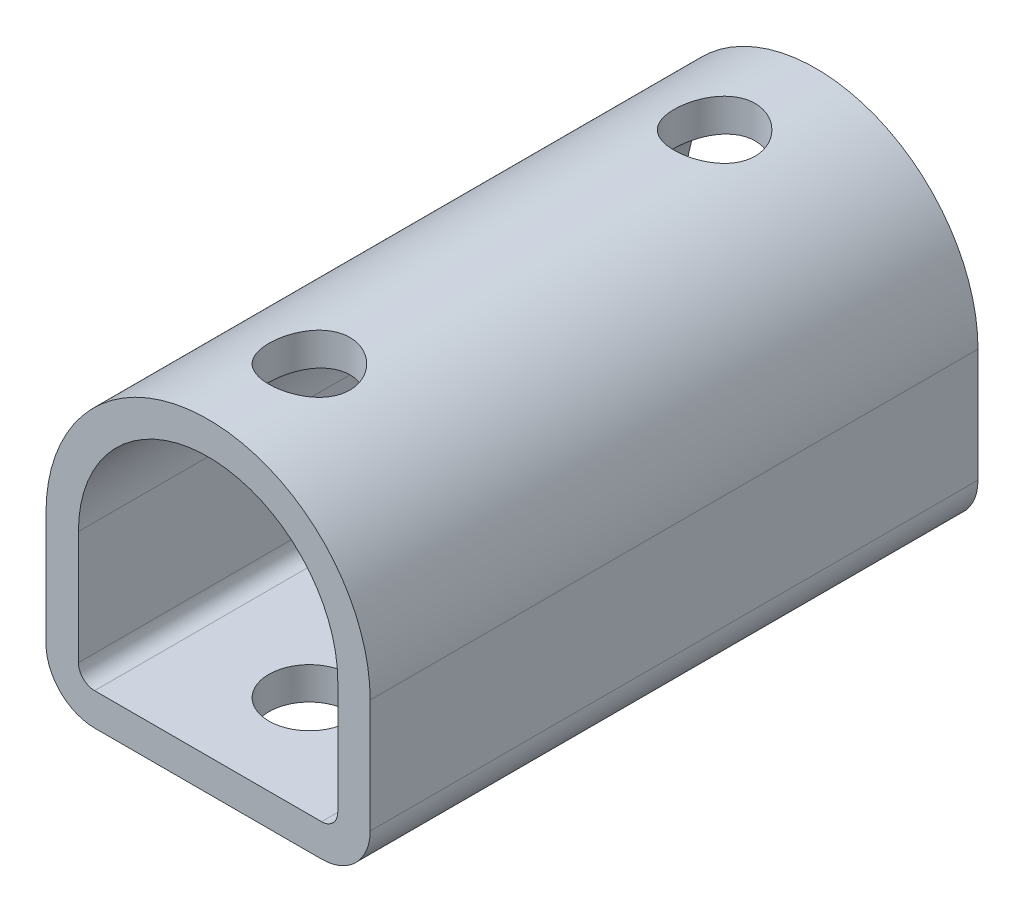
from build123d import *

# Parameters (mm, degrees)
BOSS_EXTRUDE2_DEPTH        = 37.5
F_10_0_10_DIAMETER_HOLE1_D = 10


with BuildPart() as part:
    # Sketch1 → Boss-Extrude2 (new, symmetric)
    with BuildSketch(Plane.XY):
        with BuildLine():
            Line((-20, 0), (-20, -14))
            ThreePointArc((-20, -14), (-18.242640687, -18.242640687), (-14, -20))
            Line((-14, -20), (14, -20))
            ThreePointArc((14, -20), (18.242640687, -18.242640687), (20, -14))
            Line((20, -14), (20, 0))
            ThreePointArc((20, 0), (0, 20), (-20, 0))
        make_face()
        with BuildLine():
            Line((-16, 0), (-16, -14))
            ThreePointArc((-16, -14), (-15.414213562, -15.414213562), (-14, -16))
            Line((-14, -16), (14, -16))
            ThreePointArc((14, -16), (15.414213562, -15.414213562), (16, -14))
            Line((16, -14), (16, 0))
            ThreePointArc((16, 0), (0, 16), (-16, 0))
        make_face(mode=Mode.SUBTRACT)
    extrude(amount=BOSS_EXTRUDE2_DEPTH, both=True)

    # 10.0 _10_ Diameter Hole1 (through all)
    with Locations(Plane(origin=(0, -20, 0), x_dir=(-1, 0, 0), z_dir=(0, -1, 0))):
        with Locations((0, 25), (0, -25)):
            Hole(F_10_0_10_DIAMETER_HOLE1_D / 2)


solid = part.part
